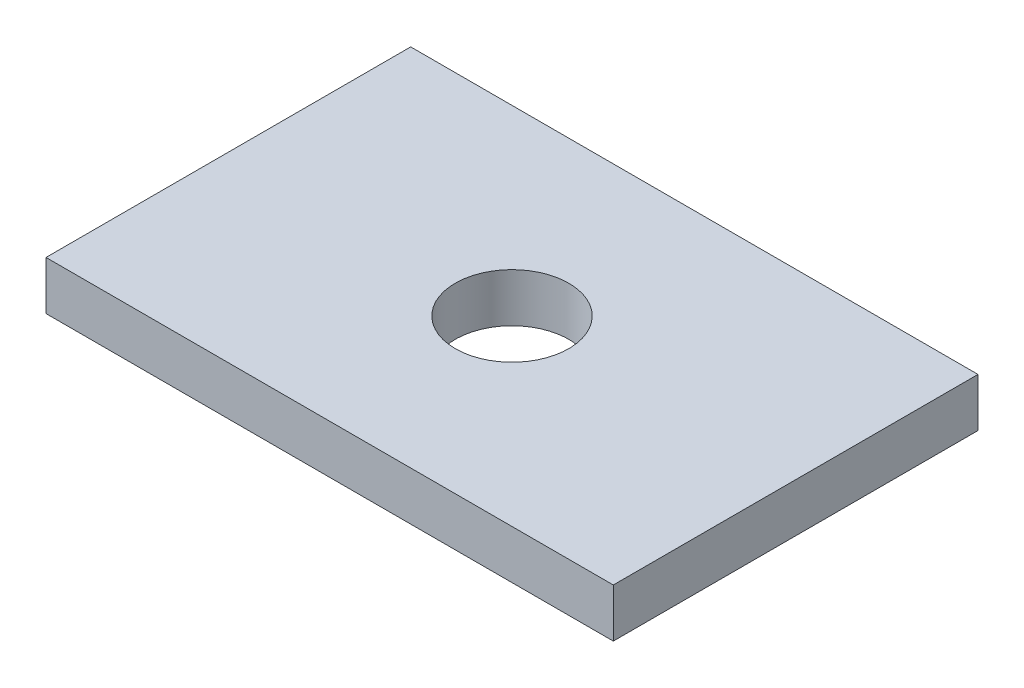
ISO-10303-21;
HEADER;
FILE_DESCRIPTION(('STEP AP214'),'2;1');
FILE_NAME('part.step','',(''),(''),'','','');
FILE_SCHEMA(('AUTOMOTIVE_DESIGN { 1 0 10303 214 1 1 1 1 }'));
ENDSEC;
DATA;
#1=APPLICATION_CONTEXT('core data for automotive mechanical design processes');
#2=APPLICATION_PROTOCOL_DEFINITION('international standard','automotive_design',2000,#1);
#3=PRODUCT_CONTEXT('',#1,'mechanical');
#4=PRODUCT('Part','Part','',(#3));
#5=PRODUCT_RELATED_PRODUCT_CATEGORY('part','',(#4));
#6=PRODUCT_DEFINITION_FORMATION('','',#4);
#7=PRODUCT_DEFINITION_CONTEXT('part definition',#1,'design');
#8=PRODUCT_DEFINITION('design','',#6,#7);
#9=PRODUCT_DEFINITION_SHAPE('','',#8);
#10=(LENGTH_UNIT() NAMED_UNIT(*) SI_UNIT(.MILLI.,.METRE.));
#11=(NAMED_UNIT(*) PLANE_ANGLE_UNIT() SI_UNIT($,.RADIAN.));
#12=(NAMED_UNIT(*) SI_UNIT($,.STERADIAN.) SOLID_ANGLE_UNIT());
#13=UNCERTAINTY_MEASURE_WITH_UNIT(LENGTH_MEASURE(1.E-05),#10,'distance_accuracy_value','');
#14=(GEOMETRIC_REPRESENTATION_CONTEXT(3) GLOBAL_UNCERTAINTY_ASSIGNED_CONTEXT((#13)) GLOBAL_UNIT_ASSIGNED_CONTEXT((#10,
#11,#12)) REPRESENTATION_CONTEXT('',''));
#15=CARTESIAN_POINT('',(0.,0.,0.));
#16=DIRECTION('',(0.,0.,1.));
#17=DIRECTION('',(1.,0.,0.));
#18=AXIS2_PLACEMENT_3D('',#15,#16,#17);
#19=CARTESIAN_POINT('',(0.,-12.,0.));
#20=DIRECTION('',(-1.,0.,0.));
#21=DIRECTION('',(0.,0.,1.));
#22=AXIS2_PLACEMENT_3D('',#19,#20,#21);
#23=PLANE('',#22);
#24=DIRECTION('',(0.,0.,1.));
#25=VECTOR('',#24,1.);
#26=CARTESIAN_POINT('',(0.,0.,0.));
#27=LINE('',#26,#25);
#28=CARTESIAN_POINT('',(0.,0.,-90.));
#29=VERTEX_POINT('',#28);
#30=CARTESIAN_POINT('',(0.,0.,0.));
#31=VERTEX_POINT('',#30);
#32=EDGE_CURVE('E106',#29,#31,#27,.T.);
#33=ORIENTED_EDGE('',*,*,#32,.F.);
#34=DIRECTION('',(0.,1.,0.));
#35=VECTOR('',#34,1.);
#36=CARTESIAN_POINT('',(0.,-12.,-90.));
#37=LINE('',#36,#35);
#38=CARTESIAN_POINT('',(0.,-12.,-90.));
#39=VERTEX_POINT('',#38);
#40=EDGE_CURVE('E11',#39,#29,#37,.T.);
#41=ORIENTED_EDGE('',*,*,#40,.F.);
#42=DIRECTION('',(0.,0.,1.));
#43=VECTOR('',#42,1.);
#44=CARTESIAN_POINT('',(0.,-12.,0.));
#45=LINE('',#44,#43);
#46=CARTESIAN_POINT('',(0.,-12.,0.));
#47=VERTEX_POINT('',#46);
#48=EDGE_CURVE('E97',#39,#47,#45,.T.);
#49=ORIENTED_EDGE('',*,*,#48,.T.);
#50=DIRECTION('',(0.,1.,0.));
#51=VECTOR('',#50,1.);
#52=CARTESIAN_POINT('',(0.,-12.,0.));
#53=LINE('',#52,#51);
#54=EDGE_CURVE('E42',#47,#31,#53,.T.);
#55=ORIENTED_EDGE('',*,*,#54,.T.);
#56=EDGE_LOOP('',(#33,#41,#49,#55));
#57=FACE_BOUND('',#56,.T.);
#58=ADVANCED_FACE('F41',(#57),#23,.T.);
#59=CARTESIAN_POINT('',(0.,-12.,-90.));
#60=DIRECTION('',(0.,0.,-1.));
#61=DIRECTION('',(-1.,0.,0.));
#62=AXIS2_PLACEMENT_3D('',#59,#60,#61);
#63=PLANE('',#62);
#64=DIRECTION('',(-1.,0.,0.));
#65=VECTOR('',#64,1.);
#66=CARTESIAN_POINT('',(0.,0.,-90.));
#67=LINE('',#66,#65);
#68=CARTESIAN_POINT('',(140.,0.,-90.));
#69=VERTEX_POINT('',#68);
#70=EDGE_CURVE('E101',#69,#29,#67,.T.);
#71=ORIENTED_EDGE('',*,*,#70,.F.);
#72=DIRECTION('',(0.,1.,0.));
#73=VECTOR('',#72,1.);
#74=CARTESIAN_POINT('',(140.,-12.,-90.));
#75=LINE('',#74,#73);
#76=CARTESIAN_POINT('',(140.,-12.,-90.));
#77=VERTEX_POINT('',#76);
#78=EDGE_CURVE('E49',#77,#69,#75,.T.);
#79=ORIENTED_EDGE('',*,*,#78,.F.);
#80=DIRECTION('',(-1.,0.,0.));
#81=VECTOR('',#80,1.);
#82=CARTESIAN_POINT('',(0.,-12.,-90.));
#83=LINE('',#82,#81);
#84=EDGE_CURVE('E96',#77,#39,#83,.T.);
#85=ORIENTED_EDGE('',*,*,#84,.T.);
#86=ORIENTED_EDGE('',*,*,#40,.T.);
#87=EDGE_LOOP('',(#71,#79,#85,#86));
#88=FACE_BOUND('',#87,.T.);
#89=ADVANCED_FACE('F119',(#88),#63,.T.);
#90=CARTESIAN_POINT('',(140.,-12.,0.));
#91=DIRECTION('',(1.,0.,0.));
#92=DIRECTION('',(0.,0.,-1.));
#93=AXIS2_PLACEMENT_3D('',#90,#91,#92);
#94=PLANE('',#93);
#95=DIRECTION('',(0.,0.,-1.));
#96=VECTOR('',#95,1.);
#97=CARTESIAN_POINT('',(140.,0.,0.));
#98=LINE('',#97,#96);
#99=CARTESIAN_POINT('',(140.,0.,0.));
#100=VERTEX_POINT('',#99);
#101=EDGE_CURVE('E93',#100,#69,#98,.T.);
#102=ORIENTED_EDGE('',*,*,#101,.F.);
#103=DIRECTION('',(0.,1.,0.));
#104=VECTOR('',#103,1.);
#105=CARTESIAN_POINT('',(140.,-12.,0.));
#106=LINE('',#105,#104);
#107=CARTESIAN_POINT('',(140.,-12.,0.));
#108=VERTEX_POINT('',#107);
#109=EDGE_CURVE('E88',#108,#100,#106,.T.);
#110=ORIENTED_EDGE('',*,*,#109,.F.);
#111=DIRECTION('',(0.,0.,-1.));
#112=VECTOR('',#111,1.);
#113=CARTESIAN_POINT('',(140.,-12.,0.));
#114=LINE('',#113,#112);
#115=EDGE_CURVE('E90',#108,#77,#114,.T.);
#116=ORIENTED_EDGE('',*,*,#115,.T.);
#117=ORIENTED_EDGE('',*,*,#78,.T.);
#118=EDGE_LOOP('',(#102,#110,#116,#117));
#119=FACE_BOUND('',#118,.T.);
#120=ADVANCED_FACE('F86',(#119),#94,.T.);
#121=CARTESIAN_POINT('',(0.,-12.,0.));
#122=DIRECTION('',(0.,0.,1.));
#123=DIRECTION('',(1.,0.,0.));
#124=AXIS2_PLACEMENT_3D('',#121,#122,#123);
#125=PLANE('',#124);
#126=DIRECTION('',(1.,0.,0.));
#127=VECTOR('',#126,1.);
#128=CARTESIAN_POINT('',(0.,0.,0.));
#129=LINE('',#128,#127);
#130=EDGE_CURVE('E108',#31,#100,#129,.T.);
#131=ORIENTED_EDGE('',*,*,#130,.F.);
#132=ORIENTED_EDGE('',*,*,#54,.F.);
#133=DIRECTION('',(1.,0.,0.));
#134=VECTOR('',#133,1.);
#135=CARTESIAN_POINT('',(0.,-12.,0.));
#136=LINE('',#135,#134);
#137=EDGE_CURVE('E92',#47,#108,#136,.T.);
#138=ORIENTED_EDGE('',*,*,#137,.T.);
#139=ORIENTED_EDGE('',*,*,#109,.T.);
#140=EDGE_LOOP('',(#131,#132,#138,#139));
#141=FACE_BOUND('',#140,.T.);
#142=ADVANCED_FACE('F98',(#141),#125,.T.);
#143=CARTESIAN_POINT('',(0.,-12.,0.));
#144=DIRECTION('',(0.,-1.,0.));
#145=DIRECTION('',(0.,0.,-1.));
#146=AXIS2_PLACEMENT_3D('',#143,#144,#145);
#147=PLANE('',#146);
#148=CARTESIAN_POINT('',(70.,-12.,-45.));
#149=DIRECTION('',(0.,1.,0.));
#150=DIRECTION('',(0.,0.,1.));
#151=AXIS2_PLACEMENT_3D('',#148,#149,#150);
#152=CIRCLE('',#151,14.);
#153=CARTESIAN_POINT('',(70.,-12.,-31.));
#154=VERTEX_POINT('',#153);
#155=EDGE_CURVE('E109',#154,#154,#152,.T.);
#156=ORIENTED_EDGE('',*,*,#155,.T.);
#157=EDGE_LOOP('',(#156));
#158=FACE_BOUND('',#157,.T.);
#159=ORIENTED_EDGE('',*,*,#48,.F.);
#160=ORIENTED_EDGE('',*,*,#84,.F.);
#161=ORIENTED_EDGE('',*,*,#115,.F.);
#162=ORIENTED_EDGE('',*,*,#137,.F.);
#163=EDGE_LOOP('',(#159,#160,#161,#162));
#164=FACE_BOUND('',#163,.T.);
#165=ADVANCED_FACE('F94',(#158,#164),#147,.T.);
#166=CARTESIAN_POINT('',(0.,0.,0.));
#167=DIRECTION('',(0.,-1.,0.));
#168=DIRECTION('',(0.,0.,-1.));
#169=AXIS2_PLACEMENT_3D('',#166,#167,#168);
#170=PLANE('',#169);
#171=CARTESIAN_POINT('',(70.,0.,-45.));
#172=DIRECTION('',(0.,1.,0.));
#173=DIRECTION('',(0.,0.,1.));
#174=AXIS2_PLACEMENT_3D('',#171,#172,#173);
#175=CIRCLE('',#174,14.);
#176=CARTESIAN_POINT('',(70.,0.,-31.));
#177=VERTEX_POINT('',#176);
#178=EDGE_CURVE('E150',#177,#177,#175,.T.);
#179=ORIENTED_EDGE('',*,*,#178,.F.);
#180=EDGE_LOOP('',(#179));
#181=FACE_BOUND('',#180,.T.);
#182=ORIENTED_EDGE('',*,*,#32,.T.);
#183=ORIENTED_EDGE('',*,*,#130,.T.);
#184=ORIENTED_EDGE('',*,*,#101,.T.);
#185=ORIENTED_EDGE('',*,*,#70,.T.);
#186=EDGE_LOOP('',(#182,#183,#184,#185));
#187=FACE_BOUND('',#186,.T.);
#188=ADVANCED_FACE('F118',(#181,#187),#170,.F.);
#189=CARTESIAN_POINT('',(70.,-12.,-45.));
#190=DIRECTION('',(0.,1.,0.));
#191=DIRECTION('',(0.,0.,1.));
#192=AXIS2_PLACEMENT_3D('',#189,#190,#191);
#193=CYLINDRICAL_SURFACE('',#192,14.);
#194=ORIENTED_EDGE('',*,*,#155,.F.);
#195=EDGE_LOOP('',(#194));
#196=FACE_BOUND('',#195,.T.);
#197=ORIENTED_EDGE('',*,*,#178,.T.);
#198=EDGE_LOOP('',(#197));
#199=FACE_BOUND('',#198,.T.);
#200=ADVANCED_FACE('F131',(#196,#199),#193,.F.);
#201=CLOSED_SHELL('',(#58,#89,#120,#142,#165,#188,#200));
#202=MANIFOLD_SOLID_BREP('B2',#201);
#203=ADVANCED_BREP_SHAPE_REPRESENTATION('',(#18,#202),#14);
#204=SHAPE_DEFINITION_REPRESENTATION(#9,#203);
ENDSEC;
END-ISO-10303-21;
